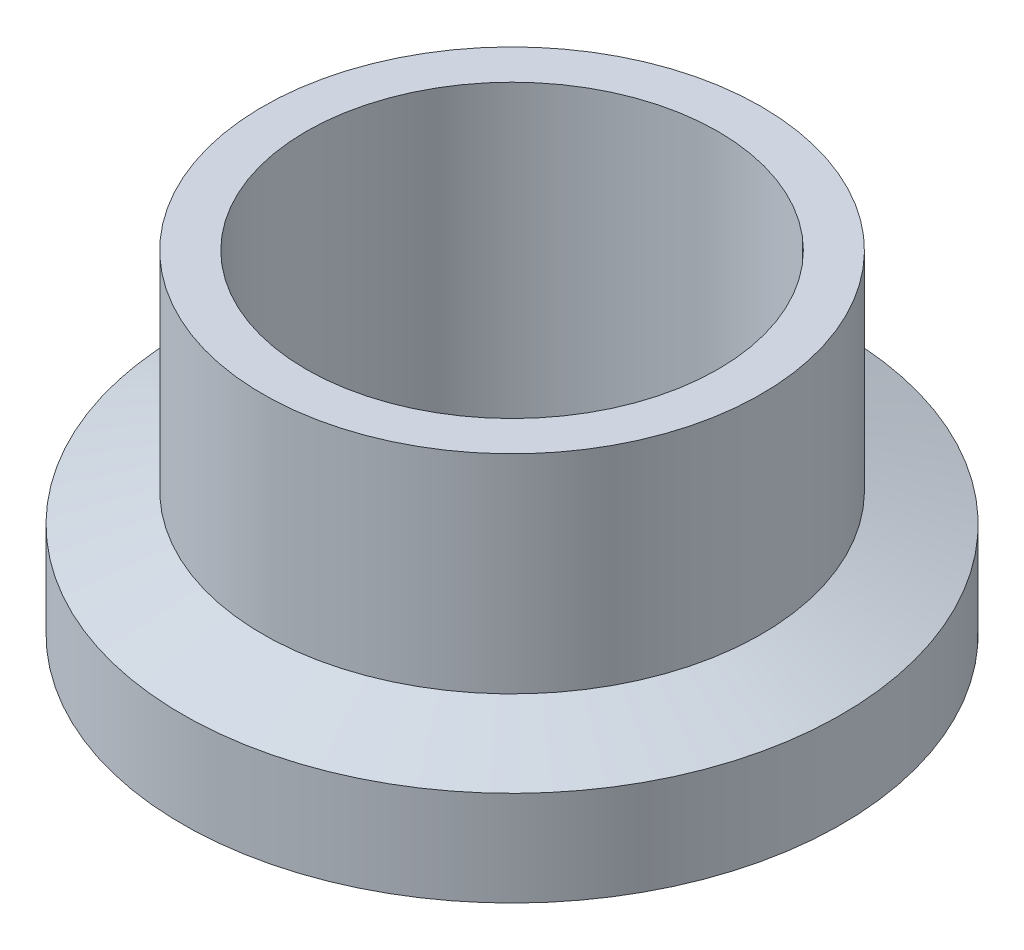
ISO-10303-21;
HEADER;
FILE_DESCRIPTION(('STEP AP214'),'2;1');
FILE_NAME('part.step','',(''),(''),'','','');
FILE_SCHEMA(('AUTOMOTIVE_DESIGN { 1 0 10303 214 1 1 1 1 }'));
ENDSEC;
DATA;
#1=APPLICATION_CONTEXT('core data for automotive mechanical design processes');
#2=APPLICATION_PROTOCOL_DEFINITION('international standard','automotive_design',2000,#1);
#3=PRODUCT_CONTEXT('',#1,'mechanical');
#4=PRODUCT('Part','Part','',(#3));
#5=PRODUCT_RELATED_PRODUCT_CATEGORY('part','',(#4));
#6=PRODUCT_DEFINITION_FORMATION('','',#4);
#7=PRODUCT_DEFINITION_CONTEXT('part definition',#1,'design');
#8=PRODUCT_DEFINITION('design','',#6,#7);
#9=PRODUCT_DEFINITION_SHAPE('','',#8);
#10=(LENGTH_UNIT() NAMED_UNIT(*) SI_UNIT(.MILLI.,.METRE.));
#11=(NAMED_UNIT(*) PLANE_ANGLE_UNIT() SI_UNIT($,.RADIAN.));
#12=(NAMED_UNIT(*) SI_UNIT($,.STERADIAN.) SOLID_ANGLE_UNIT());
#13=UNCERTAINTY_MEASURE_WITH_UNIT(LENGTH_MEASURE(1.E-05),#10,'distance_accuracy_value','');
#14=(GEOMETRIC_REPRESENTATION_CONTEXT(3) GLOBAL_UNCERTAINTY_ASSIGNED_CONTEXT((#13)) GLOBAL_UNIT_ASSIGNED_CONTEXT((#10,
#11,#12)) REPRESENTATION_CONTEXT('',''));
#15=CARTESIAN_POINT('',(0.,0.,0.));
#16=DIRECTION('',(0.,0.,1.));
#17=DIRECTION('',(1.,0.,0.));
#18=AXIS2_PLACEMENT_3D('',#15,#16,#17);
#19=CARTESIAN_POINT('',(0.,0.,0.));
#20=DIRECTION('',(0.,-1.,0.));
#21=DIRECTION('',(0.,0.,-1.00000000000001));
#22=AXIS2_PLACEMENT_3D('',#19,#20,#21);
#23=CYLINDRICAL_SURFACE('',#22,10.922);
#24=CARTESIAN_POINT('',(0.,1.32080000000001,0.));
#25=DIRECTION('',(0.,-1.,0.));
#26=DIRECTION('',(0.,0.,-1.00000000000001));
#27=AXIS2_PLACEMENT_3D('',#24,#25,#26);
#28=CIRCLE('',#27,10.922);
#29=CARTESIAN_POINT('',(0.,1.3208,-10.9220000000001));
#30=VERTEX_POINT('',#29);
#31=EDGE_CURVE('E12',#30,#30,#28,.T.);
#32=ORIENTED_EDGE('',*,*,#31,.F.);
#33=EDGE_LOOP('',(#32));
#34=FACE_BOUND('',#33,.T.);
#35=CARTESIAN_POINT('',(0.,0.,0.));
#36=DIRECTION('',(0.,-1.,0.));
#37=DIRECTION('',(0.,0.,-1.00000000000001));
#38=AXIS2_PLACEMENT_3D('',#35,#36,#37);
#39=CIRCLE('',#38,10.922);
#40=CARTESIAN_POINT('',(0.,0.,-10.9220000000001));
#41=VERTEX_POINT('',#40);
#42=EDGE_CURVE('E74',#41,#41,#39,.T.);
#43=ORIENTED_EDGE('',*,*,#42,.T.);
#44=EDGE_LOOP('',(#43));
#45=FACE_BOUND('',#44,.T.);
#46=ADVANCED_FACE('F40',(#34,#45),#23,.F.);
#47=CARTESIAN_POINT('',(0.,1.32080000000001,0.));
#48=DIRECTION('',(0.,-1.,0.));
#49=DIRECTION('',(0.,0.,-1.00000000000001));
#50=AXIS2_PLACEMENT_3D('',#47,#48,#49);
#51=TOROIDAL_SURFACE('',#50,10.1473,0.7747);
#52=CARTESIAN_POINT('',(0.,1.85299891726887,0.));
#53=DIRECTION('',(0.,-1.,0.));
#54=DIRECTION('',(0.,0.,-1.00000000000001));
#55=AXIS2_PLACEMENT_3D('',#52,#53,#54);
#56=CIRCLE('',#55,9.58433960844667);
#57=CARTESIAN_POINT('',(0.,1.85299891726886,-9.58433960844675));
#58=VERTEX_POINT('',#57);
#59=EDGE_CURVE('E46',#58,#58,#56,.T.);
#60=ORIENTED_EDGE('',*,*,#59,.F.);
#61=EDGE_LOOP('',(#60));
#62=FACE_BOUND('',#61,.T.);
#63=ORIENTED_EDGE('',*,*,#31,.T.);
#64=EDGE_LOOP('',(#63));
#65=FACE_BOUND('',#64,.T.);
#66=ADVANCED_FACE('F123',(#62,#65),#51,.F.);
#67=CARTESIAN_POINT('',(0.,1.85299891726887,0.));
#68=DIRECTION('',(0.,1.,0.));
#69=DIRECTION('',(0.,0.,1.00000000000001));
#70=AXIS2_PLACEMENT_3D('',#67,#68,#69);
#71=CONICAL_SURFACE('',#70,9.58433960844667,0.794623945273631);
#72=CARTESIAN_POINT('',(0.,0.889000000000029,0.));
#73=DIRECTION('',(0.,-1.,0.));
#74=DIRECTION('',(0.,0.,-1.00000000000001));
#75=AXIS2_PLACEMENT_3D('',#72,#73,#74);
#76=CIRCLE('',#75,8.60238725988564);
#77=CARTESIAN_POINT('',(0.,0.889000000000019,-8.60238725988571));
#78=VERTEX_POINT('',#77);
#79=EDGE_CURVE('E50',#78,#78,#76,.T.);
#80=ORIENTED_EDGE('',*,*,#79,.F.);
#81=EDGE_LOOP('',(#80));
#82=FACE_BOUND('',#81,.T.);
#83=ORIENTED_EDGE('',*,*,#59,.T.);
#84=EDGE_LOOP('',(#83));
#85=FACE_BOUND('',#84,.T.);
#86=ADVANCED_FACE('F118',(#82,#85),#71,.T.);
#87=CARTESIAN_POINT('',(-8.60238725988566,0.888999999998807,-4.44089209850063E-13));
#88=DIRECTION('',(0.,1.,0.));
#89=DIRECTION('',(0.,0.,1.00000000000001));
#90=AXIS2_PLACEMENT_3D('',#87,#88,#89);
#91=PLANE('',#90);
#92=CARTESIAN_POINT('',(0.,0.889000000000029,0.));
#93=DIRECTION('',(0.,-1.,0.));
#94=DIRECTION('',(0.,0.,-1.00000000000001));
#95=AXIS2_PLACEMENT_3D('',#92,#93,#94);
#96=CIRCLE('',#95,7.874);
#97=CARTESIAN_POINT('',(0.,0.88900000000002,-7.87400000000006));
#98=VERTEX_POINT('',#97);
#99=EDGE_CURVE('E54',#98,#98,#96,.T.);
#100=ORIENTED_EDGE('',*,*,#99,.F.);
#101=EDGE_LOOP('',(#100));
#102=FACE_BOUND('',#101,.T.);
#103=ORIENTED_EDGE('',*,*,#79,.T.);
#104=EDGE_LOOP('',(#103));
#105=FACE_BOUND('',#104,.T.);
#106=ADVANCED_FACE('F112',(#102,#105),#91,.F.);
#107=CARTESIAN_POINT('',(0.,0.,0.));
#108=DIRECTION('',(0.,-1.,0.));
#109=DIRECTION('',(0.,0.,-1.00000000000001));
#110=AXIS2_PLACEMENT_3D('',#107,#108,#109);
#111=CYLINDRICAL_SURFACE('',#110,7.874);
#112=CARTESIAN_POINT('',(1.11022302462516E-13,12.6999999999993,0.));
#113=DIRECTION('',(0.,-1.,0.));
#114=DIRECTION('',(0.,0.,-1.00000000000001));
#115=AXIS2_PLACEMENT_3D('',#112,#113,#114);
#116=CIRCLE('',#115,7.874);
#117=CARTESIAN_POINT('',(0.,12.6999999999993,-7.87400000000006));
#118=VERTEX_POINT('',#117);
#119=EDGE_CURVE('E59',#118,#118,#116,.T.);
#120=ORIENTED_EDGE('',*,*,#119,.F.);
#121=EDGE_LOOP('',(#120));
#122=FACE_BOUND('',#121,.T.);
#123=ORIENTED_EDGE('',*,*,#99,.T.);
#124=EDGE_LOOP('',(#123));
#125=FACE_BOUND('',#124,.T.);
#126=ADVANCED_FACE('F106',(#122,#125),#111,.F.);
#127=CARTESIAN_POINT('',(-7.87400000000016,12.6999999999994,-4.44089209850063E-13));
#128=DIRECTION('',(0.,-1.,0.));
#129=DIRECTION('',(0.,0.,-1.00000000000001));
#130=AXIS2_PLACEMENT_3D('',#127,#128,#129);
#131=PLANE('',#130);
#132=CARTESIAN_POINT('',(1.11022302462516E-13,12.6999999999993,0.));
#133=DIRECTION('',(0.,-1.,0.));
#134=DIRECTION('',(0.,0.,-1.00000000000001));
#135=AXIS2_PLACEMENT_3D('',#132,#133,#134);
#136=CIRCLE('',#135,9.525);
#137=CARTESIAN_POINT('',(0.,12.6999999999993,-9.52500000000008));
#138=VERTEX_POINT('',#137);
#139=EDGE_CURVE('E62',#138,#138,#136,.T.);
#140=ORIENTED_EDGE('',*,*,#139,.F.);
#141=EDGE_LOOP('',(#140));
#142=FACE_BOUND('',#141,.T.);
#143=ORIENTED_EDGE('',*,*,#119,.T.);
#144=EDGE_LOOP('',(#143));
#145=FACE_BOUND('',#144,.T.);
#146=ADVANCED_FACE('F100',(#142,#145),#131,.F.);
#147=CARTESIAN_POINT('',(0.,0.,0.));
#148=DIRECTION('',(0.,-1.,0.));
#149=DIRECTION('',(0.,0.,-1.00000000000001));
#150=AXIS2_PLACEMENT_3D('',#147,#148,#149);
#151=CYLINDRICAL_SURFACE('',#150,9.525);
#152=CARTESIAN_POINT('',(0.,4.7508261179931,0.));
#153=DIRECTION('',(0.,-1.,0.));
#154=DIRECTION('',(0.,0.,-1.00000000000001));
#155=AXIS2_PLACEMENT_3D('',#152,#153,#154);
#156=CIRCLE('',#155,9.525);
#157=CARTESIAN_POINT('',(0.,4.75082611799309,-9.52500000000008));
#158=VERTEX_POINT('',#157);
#159=EDGE_CURVE('E65',#158,#158,#156,.T.);
#160=ORIENTED_EDGE('',*,*,#159,.F.);
#161=EDGE_LOOP('',(#160));
#162=FACE_BOUND('',#161,.T.);
#163=ORIENTED_EDGE('',*,*,#139,.T.);
#164=EDGE_LOOP('',(#163));
#165=FACE_BOUND('',#164,.T.);
#166=ADVANCED_FACE('F94',(#162,#165),#151,.T.);
#167=CARTESIAN_POINT('',(0.,4.7508261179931,0.));
#168=DIRECTION('',(0.,-1.,0.));
#169=DIRECTION('',(0.,0.,-1.00000000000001));
#170=AXIS2_PLACEMENT_3D('',#167,#168,#169);
#171=CONICAL_SURFACE('',#170,9.525,1.22173047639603);
#172=CARTESIAN_POINT('',(2.22044604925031E-13,3.63219999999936,2.22044604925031E-13));
#173=DIRECTION('',(0.,-1.,0.));
#174=DIRECTION('',(0.,0.,-1.00000000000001));
#175=AXIS2_PLACEMENT_3D('',#172,#173,#174);
#176=CIRCLE('',#175,12.5984);
#177=CARTESIAN_POINT('',(2.03162109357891E-13,3.63219999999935,-12.5983999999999));
#178=VERTEX_POINT('',#177);
#179=EDGE_CURVE('E68',#178,#178,#176,.T.);
#180=ORIENTED_EDGE('',*,*,#179,.F.);
#181=EDGE_LOOP('',(#180));
#182=FACE_BOUND('',#181,.T.);
#183=ORIENTED_EDGE('',*,*,#159,.T.);
#184=EDGE_LOOP('',(#183));
#185=FACE_BOUND('',#184,.T.);
#186=ADVANCED_FACE('F88',(#182,#185),#171,.T.);
#187=CARTESIAN_POINT('',(0.,0.,0.));
#188=DIRECTION('',(0.,-1.,0.));
#189=DIRECTION('',(0.,0.,-1.00000000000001));
#190=AXIS2_PLACEMENT_3D('',#187,#188,#189);
#191=CYLINDRICAL_SURFACE('',#190,12.5984);
#192=CARTESIAN_POINT('',(0.,0.,0.));
#193=DIRECTION('',(0.,-1.,0.));
#194=DIRECTION('',(0.,0.,-1.00000000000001));
#195=AXIS2_PLACEMENT_3D('',#192,#193,#194);
#196=CIRCLE('',#195,12.5984);
#197=CARTESIAN_POINT('',(0.,0.,-12.5984000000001));
#198=VERTEX_POINT('',#197);
#199=EDGE_CURVE('E71',#198,#198,#196,.T.);
#200=ORIENTED_EDGE('',*,*,#199,.F.);
#201=EDGE_LOOP('',(#200));
#202=FACE_BOUND('',#201,.T.);
#203=ORIENTED_EDGE('',*,*,#179,.T.);
#204=EDGE_LOOP('',(#203));
#205=FACE_BOUND('',#204,.T.);
#206=ADVANCED_FACE('F82',(#202,#205),#191,.T.);
#207=CARTESIAN_POINT('',(-12.5984,-1.22124532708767E-12,-2.22044604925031E-13));
#208=DIRECTION('',(0.,1.,0.));
#209=DIRECTION('',(0.,0.,1.00000000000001));
#210=AXIS2_PLACEMENT_3D('',#207,#208,#209);
#211=PLANE('',#210);
#212=ORIENTED_EDGE('',*,*,#42,.F.);
#213=EDGE_LOOP('',(#212));
#214=FACE_BOUND('',#213,.T.);
#215=ORIENTED_EDGE('',*,*,#199,.T.);
#216=EDGE_LOOP('',(#215));
#217=FACE_BOUND('',#216,.T.);
#218=ADVANCED_FACE('F79',(#214,#217),#211,.F.);
#219=CLOSED_SHELL('',(#46,#66,#86,#106,#126,#146,#166,#186,#206,#218));
#220=MANIFOLD_SOLID_BREP('B2',#219);
#221=ADVANCED_BREP_SHAPE_REPRESENTATION('',(#18,#220),#14);
#222=SHAPE_DEFINITION_REPRESENTATION(#9,#221);
ENDSEC;
END-ISO-10303-21;
